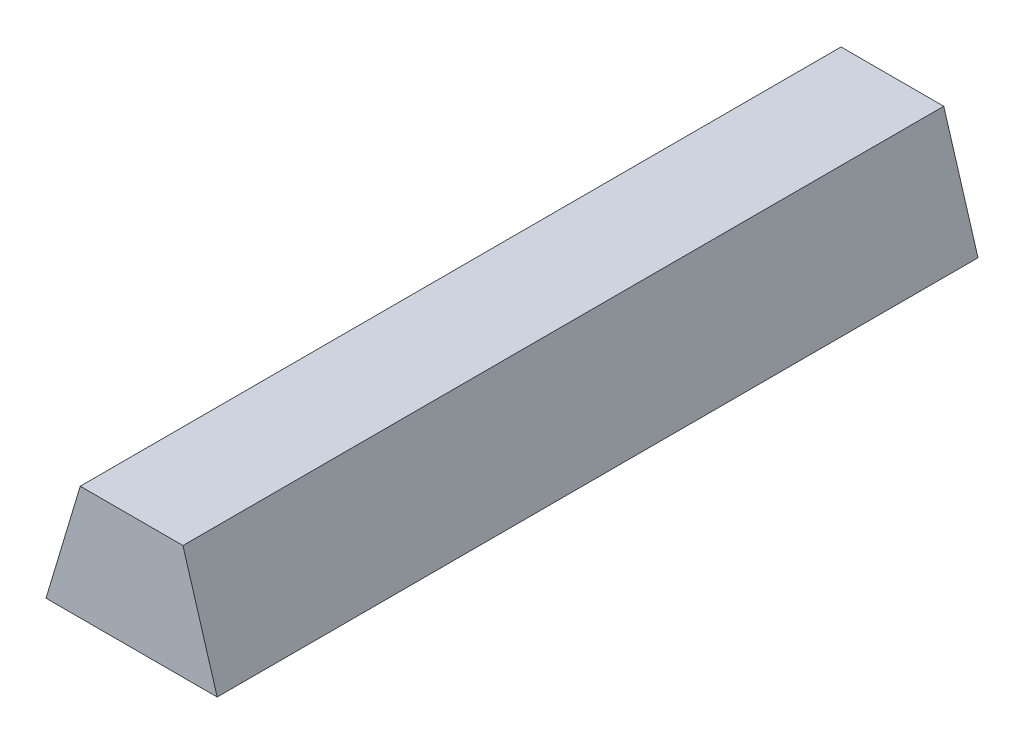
from build123d import *

# Parameters (mm, degrees)
EXTRUDE_1_DEPTH = 2000


with BuildPart() as part:
    # Sketch 1 → Extrude 1 (new body)
    with BuildSketch(Plane.XY):
        Polygon((135, 150), (225, -150), (-225, -150), (-135, 150), align=None)
    extrude(amount=EXTRUDE_1_DEPTH)


solid = part.part
